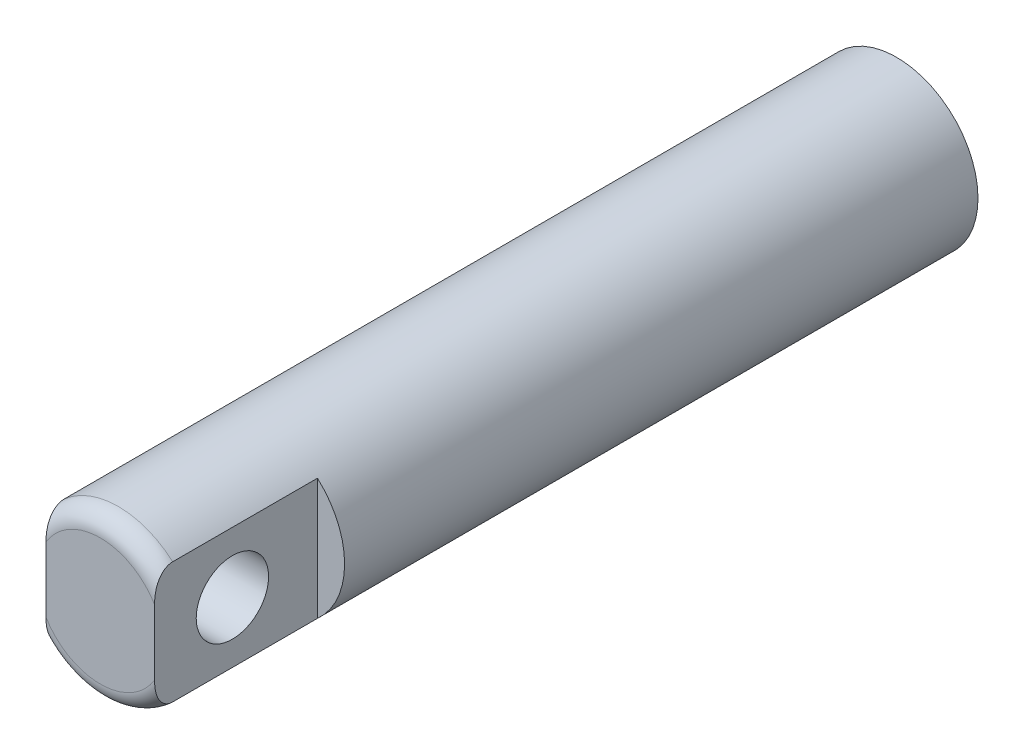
ISO-10303-21;
HEADER;
FILE_DESCRIPTION(('STEP AP214'),'2;1');
FILE_NAME('part.step','',(''),(''),'','','');
FILE_SCHEMA(('AUTOMOTIVE_DESIGN { 1 0 10303 214 1 1 1 1 }'));
ENDSEC;
DATA;
#1=APPLICATION_CONTEXT('core data for automotive mechanical design processes');
#2=APPLICATION_PROTOCOL_DEFINITION('international standard','automotive_design',2000,#1);
#3=PRODUCT_CONTEXT('',#1,'mechanical');
#4=PRODUCT('Part','Part','',(#3));
#5=PRODUCT_RELATED_PRODUCT_CATEGORY('part','',(#4));
#6=PRODUCT_DEFINITION_FORMATION('','',#4);
#7=PRODUCT_DEFINITION_CONTEXT('part definition',#1,'design');
#8=PRODUCT_DEFINITION('design','',#6,#7);
#9=PRODUCT_DEFINITION_SHAPE('','',#8);
#10=(LENGTH_UNIT() NAMED_UNIT(*) SI_UNIT(.MILLI.,.METRE.));
#11=(NAMED_UNIT(*) PLANE_ANGLE_UNIT() SI_UNIT($,.RADIAN.));
#12=(NAMED_UNIT(*) SI_UNIT($,.STERADIAN.) SOLID_ANGLE_UNIT());
#13=UNCERTAINTY_MEASURE_WITH_UNIT(LENGTH_MEASURE(1.E-05),#10,'distance_accuracy_value','');
#14=(GEOMETRIC_REPRESENTATION_CONTEXT(3) GLOBAL_UNCERTAINTY_ASSIGNED_CONTEXT((#13)) GLOBAL_UNIT_ASSIGNED_CONTEXT((#10,
#11,#12)) REPRESENTATION_CONTEXT('',''));
#15=CARTESIAN_POINT('',(0.,0.,0.));
#16=DIRECTION('',(0.,0.,1.));
#17=DIRECTION('',(1.,0.,0.));
#18=AXIS2_PLACEMENT_3D('',#15,#16,#17);
#19=CARTESIAN_POINT('',(0.,0.,35.));
#20=DIRECTION('',(0.,0.,1.));
#21=DIRECTION('',(1.,0.,0.));
#22=AXIS2_PLACEMENT_3D('',#19,#20,#21);
#23=PLANE('',#22);
#24=CARTESIAN_POINT('',(0.,0.,35.));
#25=DIRECTION('',(0.,0.,1.));
#26=DIRECTION('',(1.,0.,0.));
#27=AXIS2_PLACEMENT_3D('',#24,#25,#26);
#28=CIRCLE('',#27,4.5);
#29=CARTESIAN_POINT('',(-3.,3.35410196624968,35.));
#30=VERTEX_POINT('',#29);
#31=CARTESIAN_POINT('',(-3.,-3.35410196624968,35.));
#32=VERTEX_POINT('',#31);
#33=EDGE_CURVE('E96',#30,#32,#28,.T.);
#34=ORIENTED_EDGE('',*,*,#33,.T.);
#35=DIRECTION('',(0.,1.,0.));
#36=VECTOR('',#35,1.);
#37=CARTESIAN_POINT('',(-3.,0.,35.));
#38=LINE('',#37,#36);
#39=EDGE_CURVE('E102',#32,#30,#38,.T.);
#40=ORIENTED_EDGE('',*,*,#39,.T.);
#41=EDGE_LOOP('',(#34,#40));
#42=FACE_BOUND('',#41,.T.);
#43=ADVANCED_FACE('F35',(#42),#23,.T.);
#44=CARTESIAN_POINT('',(0.,0.,35.));
#45=DIRECTION('',(0.,0.,-1.));
#46=DIRECTION('',(-1.,0.,0.));
#47=AXIS2_PLACEMENT_3D('',#44,#45,#46);
#48=CYLINDRICAL_SURFACE('',#47,4.5);
#49=DIRECTION('',(0.,0.,-1.));
#50=VECTOR('',#49,1.);
#51=CARTESIAN_POINT('',(3.,-3.35410196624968,44.));
#52=LINE('',#51,#50);
#53=CARTESIAN_POINT('',(3.,-3.35410196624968,43.));
#54=VERTEX_POINT('',#53);
#55=CARTESIAN_POINT('',(3.,-3.35410196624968,35.));
#56=VERTEX_POINT('',#55);
#57=EDGE_CURVE('E99',#54,#56,#52,.T.);
#58=ORIENTED_EDGE('',*,*,#57,.F.);
#59=CARTESIAN_POINT('',(0.,0.,43.));
#60=DIRECTION('',(0.,0.,1.));
#61=DIRECTION('',(1.,0.,0.));
#62=AXIS2_PLACEMENT_3D('',#59,#60,#61);
#63=CIRCLE('',#62,4.5);
#64=CARTESIAN_POINT('',(-3.,-3.35410196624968,43.));
#65=VERTEX_POINT('',#64);
#66=EDGE_CURVE('E56',#54,#65,#63,.F.);
#67=ORIENTED_EDGE('',*,*,#66,.T.);
#68=DIRECTION('',(0.,0.,-1.));
#69=VECTOR('',#68,1.);
#70=CARTESIAN_POINT('',(-3.,-3.35410196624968,44.));
#71=LINE('',#70,#69);
#72=EDGE_CURVE('E91',#65,#32,#71,.T.);
#73=ORIENTED_EDGE('',*,*,#72,.T.);
#74=ORIENTED_EDGE('',*,*,#33,.F.);
#75=DIRECTION('',(0.,0.,-1.));
#76=VECTOR('',#75,1.);
#77=CARTESIAN_POINT('',(-3.,3.35410196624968,44.));
#78=LINE('',#77,#76);
#79=CARTESIAN_POINT('',(-3.,3.35410196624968,43.));
#80=VERTEX_POINT('',#79);
#81=EDGE_CURVE('E98',#80,#30,#78,.T.);
#82=ORIENTED_EDGE('',*,*,#81,.F.);
#83=CARTESIAN_POINT('',(0.,0.,43.));
#84=DIRECTION('',(0.,0.,1.));
#85=DIRECTION('',(1.,0.,0.));
#86=AXIS2_PLACEMENT_3D('',#83,#84,#85);
#87=CIRCLE('',#86,4.5);
#88=CARTESIAN_POINT('',(3.,3.35410196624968,43.));
#89=VERTEX_POINT('',#88);
#90=EDGE_CURVE('E159',#80,#89,#87,.F.);
#91=ORIENTED_EDGE('',*,*,#90,.T.);
#92=DIRECTION('',(0.,0.,-1.));
#93=VECTOR('',#92,1.);
#94=CARTESIAN_POINT('',(3.,3.35410196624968,44.));
#95=LINE('',#94,#93);
#96=CARTESIAN_POINT('',(3.,3.35410196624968,35.));
#97=VERTEX_POINT('',#96);
#98=EDGE_CURVE('E171',#89,#97,#95,.T.);
#99=ORIENTED_EDGE('',*,*,#98,.T.);
#100=EDGE_CURVE('E109',#56,#97,#28,.T.);
#101=ORIENTED_EDGE('',*,*,#100,.F.);
#102=EDGE_LOOP('',(#58,#67,#73,#74,#82,#91,#99,#101));
#103=FACE_BOUND('',#102,.T.);
#104=CARTESIAN_POINT('',(0.,0.,0.));
#105=DIRECTION('',(0.,0.,1.));
#106=DIRECTION('',(1.,0.,0.));
#107=AXIS2_PLACEMENT_3D('',#104,#105,#106);
#108=CIRCLE('',#107,4.5);
#109=CARTESIAN_POINT('',(4.5,0.,0.));
#110=VERTEX_POINT('',#109);
#111=EDGE_CURVE('E115',#110,#110,#108,.T.);
#112=ORIENTED_EDGE('',*,*,#111,.T.);
#113=EDGE_LOOP('',(#112));
#114=FACE_BOUND('',#113,.T.);
#115=ADVANCED_FACE('F93',(#103,#114),#48,.T.);
#116=DIRECTION('',(0.,1.,0.));
#117=VECTOR('',#116,1.);
#118=CARTESIAN_POINT('',(3.,0.,35.));
#119=LINE('',#118,#117);
#120=EDGE_CURVE('E105',#56,#97,#119,.T.);
#121=ORIENTED_EDGE('',*,*,#120,.F.);
#122=ORIENTED_EDGE('',*,*,#100,.T.);
#123=EDGE_LOOP('',(#121,#122));
#124=FACE_BOUND('',#123,.T.);
#125=ADVANCED_FACE('F151',(#124),#23,.T.);
#126=CARTESIAN_POINT('',(0.,0.,0.));
#127=DIRECTION('',(0.,0.,1.));
#128=DIRECTION('',(1.,0.,0.));
#129=AXIS2_PLACEMENT_3D('',#126,#127,#128);
#130=PLANE('',#129);
#131=ORIENTED_EDGE('',*,*,#111,.F.);
#132=EDGE_LOOP('',(#131));
#133=FACE_BOUND('',#132,.T.);
#134=ADVANCED_FACE('F149',(#133),#130,.F.);
#135=CARTESIAN_POINT('',(-3.,0.,44.));
#136=DIRECTION('',(-1.,0.,0.));
#137=DIRECTION('',(0.,0.,1.));
#138=AXIS2_PLACEMENT_3D('',#135,#136,#137);
#139=PLANE('',#138);
#140=CARTESIAN_POINT('',(-3.,0.,39.7));
#141=DIRECTION('',(-1.,0.,0.));
#142=DIRECTION('',(0.,0.,1.));
#143=AXIS2_PLACEMENT_3D('',#140,#141,#142);
#144=CIRCLE('',#143,2.);
#145=CARTESIAN_POINT('',(-3.,0.,41.7));
#146=VERTEX_POINT('',#145);
#147=EDGE_CURVE('E121',#146,#146,#144,.T.);
#148=ORIENTED_EDGE('',*,*,#147,.F.);
#149=EDGE_LOOP('',(#148));
#150=FACE_BOUND('',#149,.T.);
#151=ORIENTED_EDGE('',*,*,#72,.F.);
#152=CARTESIAN_POINT('',(-3.,-3.35410196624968,43.));
#153=CARTESIAN_POINT('',(-3.,-3.35410454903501,43.0227438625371));
#154=CARTESIAN_POINT('',(-3.,-3.35306009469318,43.0454749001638));
#155=CARTESIAN_POINT('',(-3.,-3.34891222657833,43.0907369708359));
#156=CARTESIAN_POINT('',(-3.,-3.34580985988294,43.1132680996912));
#157=CARTESIAN_POINT('',(-3.,-3.33352701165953,43.1800084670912));
#158=CARTESIAN_POINT('',(-3.,-3.32136959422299,43.2237015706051));
#159=CARTESIAN_POINT('',(-3.,-3.28985961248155,43.3082718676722));
#160=CARTESIAN_POINT('',(-3.,-3.27051886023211,43.3491535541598));
#161=CARTESIAN_POINT('',(-3.,-3.22563998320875,43.4274112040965));
#162=CARTESIAN_POINT('',(-3.,-3.20009153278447,43.4647811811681));
#163=CARTESIAN_POINT('',(-3.,-3.13519094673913,43.5464202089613));
#164=CARTESIAN_POINT('',(-3.,-3.09401470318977,43.5892380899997));
#165=CARTESIAN_POINT('',(-3.,-3.00528363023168,43.6675578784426));
#166=CARTESIAN_POINT('',(-3.,-2.95772326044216,43.7030533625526));
#167=CARTESIAN_POINT('',(-3.,-2.83879019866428,43.7794086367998));
#168=CARTESIAN_POINT('',(-3.,-2.76533540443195,43.8170109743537));
#169=CARTESIAN_POINT('',(-3.,-2.61322737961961,43.880326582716));
#170=CARTESIAN_POINT('',(-3.,-2.53454852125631,43.9059753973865));
#171=CARTESIAN_POINT('',(-3.,-2.34752333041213,43.9540625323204));
#172=CARTESIAN_POINT('',(-3.,-2.23815778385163,43.9724682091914));
#173=CARTESIAN_POINT('',(-3.,-2.07412278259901,43.9896598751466));
#174=CARTESIAN_POINT('',(-3.,-2.01986832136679,43.9936624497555));
#175=CARTESIAN_POINT('',(-3.,-1.91133646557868,43.9988264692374));
#176=CARTESIAN_POINT('',(-3.,-1.85705936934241,43.9999939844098));
#177=CARTESIAN_POINT('',(-3.,-1.80277563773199,44.));
#178=B_SPLINE_CURVE_WITH_KNOTS('',3,(#152,#153,#154,#155,#156,#157,#158,#159,#160,#161,#162,
#163,#164,#165,#166,#167,#168,#169,#170,#171,#172,#173,#174,#175,#176,#177),.UNSPECIFIED.,.F.,
.F.,(4,2,2,2,2,2,2,2,2,2,2,2,4),(0.,0.0681829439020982,0.136331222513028,0.271631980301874,
0.406711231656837,0.542016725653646,0.71925550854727,0.896649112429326,1.14283280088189,
1.39032903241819,1.72168681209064,1.88484827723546,2.04766007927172),.UNSPECIFIED.);
#179=CARTESIAN_POINT('',(-3.,-1.80277563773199,44.));
#180=VERTEX_POINT('',#179);
#181=EDGE_CURVE('E11',#65,#180,#178,.T.);
#182=ORIENTED_EDGE('',*,*,#181,.T.);
#183=DIRECTION('',(0.,1.,0.));
#184=VECTOR('',#183,1.);
#185=CARTESIAN_POINT('',(-3.,0.,44.));
#186=LINE('',#185,#184);
#187=CARTESIAN_POINT('',(-3.,1.80277563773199,44.));
#188=VERTEX_POINT('',#187);
#189=EDGE_CURVE('E175',#180,#188,#186,.T.);
#190=ORIENTED_EDGE('',*,*,#189,.T.);
#191=CARTESIAN_POINT('',(-3.,1.80277563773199,44.));
#192=CARTESIAN_POINT('',(-3.,1.86473915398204,43.999992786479));
#193=CARTESIAN_POINT('',(-3.,1.92675064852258,43.998470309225));
#194=CARTESIAN_POINT('',(-3.,2.05078914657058,43.9916379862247));
#195=CARTESIAN_POINT('',(-3.,2.11281534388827,43.9863140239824));
#196=CARTESIAN_POINT('',(-3.,2.23730506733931,43.9709914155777));
#197=CARTESIAN_POINT('',(-3.,2.29976017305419,43.9609206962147));
#198=CARTESIAN_POINT('',(-3.,2.42344502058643,43.9352569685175));
#199=CARTESIAN_POINT('',(-3.,2.48467656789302,43.9196728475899));
#200=CARTESIAN_POINT('',(-3.,2.61234803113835,43.879881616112));
#201=CARTESIAN_POINT('',(-3.,2.67854464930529,43.8548711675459));
#202=CARTESIAN_POINT('',(-3.,2.80653228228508,43.7957666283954));
#203=CARTESIAN_POINT('',(-3.,2.86834066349,43.7617112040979));
#204=CARTESIAN_POINT('',(-3.,2.97499791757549,43.6904697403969));
#205=CARTESIAN_POINT('',(-3.,3.02091493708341,43.6548963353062));
#206=CARTESIAN_POINT('',(-3.,3.10641620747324,43.5767219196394));
#207=CARTESIAN_POINT('',(-3.,3.14600368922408,43.5341245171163));
#208=CARTESIAN_POINT('',(-3.,3.20989194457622,43.4510406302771));
#209=CARTESIAN_POINT('',(-3.,3.23566809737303,43.4116915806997));
#210=CARTESIAN_POINT('',(-3.,3.28033489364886,43.3292989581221));
#211=CARTESIAN_POINT('',(-3.,3.29923796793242,43.286262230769));
#212=CARTESIAN_POINT('',(-3.,3.32720196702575,43.2030734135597));
#213=CARTESIAN_POINT('',(-3.,3.33720012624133,43.1632367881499));
#214=CARTESIAN_POINT('',(-3.,3.350694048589,43.0822883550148));
#215=CARTESIAN_POINT('',(-3.,3.35415849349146,43.0411713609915));
#216=CARTESIAN_POINT('',(-3.,3.35410196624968,43.));
#217=B_SPLINE_CURVE_WITH_KNOTS('',3,(#191,#192,#193,#194,#195,#196,#197,#198,#199,#200,#201,
#202,#203,#204,#205,#206,#207,#208,#209,#210,#211,#212,#213,#214,#215,#216),.UNSPECIFIED.,.F.,
.F.,(4,2,2,2,2,2,2,2,2,2,2,2,4),(0.,0.185944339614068,0.372582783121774,0.562151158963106,
0.751415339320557,0.963120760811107,1.17393533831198,1.34755258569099,1.52108092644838,
1.66162972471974,1.80192304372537,1.92461580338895,2.04789518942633),.UNSPECIFIED.);
#218=EDGE_CURVE('E49',#188,#80,#217,.T.);
#219=ORIENTED_EDGE('',*,*,#218,.T.);
#220=ORIENTED_EDGE('',*,*,#81,.T.);
#221=ORIENTED_EDGE('',*,*,#39,.F.);
#222=EDGE_LOOP('',(#151,#182,#190,#219,#220,#221));
#223=FACE_BOUND('',#222,.T.);
#224=ADVANCED_FACE('F103',(#150,#223),#139,.T.);
#225=CARTESIAN_POINT('',(3.,0.,44.));
#226=DIRECTION('',(-1.,0.,0.));
#227=DIRECTION('',(0.,0.,1.));
#228=AXIS2_PLACEMENT_3D('',#225,#226,#227);
#229=PLANE('',#228);
#230=CARTESIAN_POINT('',(3.,0.,39.7));
#231=DIRECTION('',(-1.,0.,0.));
#232=DIRECTION('',(0.,0.,1.));
#233=AXIS2_PLACEMENT_3D('',#230,#231,#232);
#234=CIRCLE('',#233,2.);
#235=CARTESIAN_POINT('',(3.,0.,41.7));
#236=VERTEX_POINT('',#235);
#237=EDGE_CURVE('E106',#236,#236,#234,.T.);
#238=ORIENTED_EDGE('',*,*,#237,.T.);
#239=EDGE_LOOP('',(#238));
#240=FACE_BOUND('',#239,.T.);
#241=DIRECTION('',(0.,1.,0.));
#242=VECTOR('',#241,1.);
#243=CARTESIAN_POINT('',(3.,0.,44.));
#244=LINE('',#243,#242);
#245=CARTESIAN_POINT('',(3.,-1.80277563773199,44.));
#246=VERTEX_POINT('',#245);
#247=CARTESIAN_POINT('',(3.,1.80277563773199,44.));
#248=VERTEX_POINT('',#247);
#249=EDGE_CURVE('E167',#246,#248,#244,.T.);
#250=ORIENTED_EDGE('',*,*,#249,.F.);
#251=CARTESIAN_POINT('',(3.,-1.80277563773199,44.));
#252=CARTESIAN_POINT('',(3.,-1.86473915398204,43.999992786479));
#253=CARTESIAN_POINT('',(3.,-1.92675064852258,43.998470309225));
#254=CARTESIAN_POINT('',(3.,-2.05078914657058,43.9916379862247));
#255=CARTESIAN_POINT('',(3.,-2.11281534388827,43.9863140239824));
#256=CARTESIAN_POINT('',(3.,-2.23730506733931,43.9709914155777));
#257=CARTESIAN_POINT('',(3.,-2.29976017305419,43.9609206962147));
#258=CARTESIAN_POINT('',(3.,-2.42344502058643,43.9352569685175));
#259=CARTESIAN_POINT('',(3.,-2.48467656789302,43.9196728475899));
#260=CARTESIAN_POINT('',(3.,-2.61234803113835,43.879881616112));
#261=CARTESIAN_POINT('',(3.,-2.67854464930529,43.8548711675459));
#262=CARTESIAN_POINT('',(3.,-2.80653228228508,43.7957666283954));
#263=CARTESIAN_POINT('',(3.,-2.86834066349,43.7617112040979));
#264=CARTESIAN_POINT('',(3.,-2.97499791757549,43.6904697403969));
#265=CARTESIAN_POINT('',(3.,-3.02091493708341,43.6548963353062));
#266=CARTESIAN_POINT('',(3.,-3.10641620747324,43.5767219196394));
#267=CARTESIAN_POINT('',(3.,-3.14600368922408,43.5341245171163));
#268=CARTESIAN_POINT('',(3.,-3.20989194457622,43.4510406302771));
#269=CARTESIAN_POINT('',(3.,-3.23566809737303,43.4116915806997));
#270=CARTESIAN_POINT('',(3.,-3.28033489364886,43.3292989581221));
#271=CARTESIAN_POINT('',(3.,-3.29923796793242,43.286262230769));
#272=CARTESIAN_POINT('',(3.,-3.32720196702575,43.2030734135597));
#273=CARTESIAN_POINT('',(3.,-3.33720012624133,43.1632367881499));
#274=CARTESIAN_POINT('',(3.,-3.350694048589,43.0822883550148));
#275=CARTESIAN_POINT('',(3.,-3.35415849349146,43.0411713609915));
#276=CARTESIAN_POINT('',(3.,-3.35410196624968,43.));
#277=B_SPLINE_CURVE_WITH_KNOTS('',3,(#251,#252,#253,#254,#255,#256,#257,#258,#259,#260,#261,
#262,#263,#264,#265,#266,#267,#268,#269,#270,#271,#272,#273,#274,#275,#276),.UNSPECIFIED.,.F.,
.F.,(4,2,2,2,2,2,2,2,2,2,2,2,4),(0.,0.185944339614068,0.372582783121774,0.562151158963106,
0.751415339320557,0.963120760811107,1.17393533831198,1.34755258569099,1.52108092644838,
1.66162972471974,1.80192304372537,1.92461580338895,2.04789518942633),.UNSPECIFIED.);
#278=EDGE_CURVE('E132',#246,#54,#277,.T.);
#279=ORIENTED_EDGE('',*,*,#278,.T.);
#280=ORIENTED_EDGE('',*,*,#57,.T.);
#281=ORIENTED_EDGE('',*,*,#120,.T.);
#282=ORIENTED_EDGE('',*,*,#98,.F.);
#283=CARTESIAN_POINT('',(3.,3.35410196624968,43.));
#284=CARTESIAN_POINT('',(3.,3.35410454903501,43.0227438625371));
#285=CARTESIAN_POINT('',(3.,3.35306009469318,43.0454749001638));
#286=CARTESIAN_POINT('',(3.,3.34891222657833,43.0907369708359));
#287=CARTESIAN_POINT('',(3.,3.34580985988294,43.1132680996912));
#288=CARTESIAN_POINT('',(3.,3.33352701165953,43.1800084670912));
#289=CARTESIAN_POINT('',(3.,3.32136959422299,43.2237015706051));
#290=CARTESIAN_POINT('',(3.,3.28985961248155,43.3082718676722));
#291=CARTESIAN_POINT('',(3.,3.27051886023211,43.3491535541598));
#292=CARTESIAN_POINT('',(3.,3.22563998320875,43.4274112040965));
#293=CARTESIAN_POINT('',(3.,3.20009153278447,43.4647811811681));
#294=CARTESIAN_POINT('',(3.,3.13519094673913,43.5464202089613));
#295=CARTESIAN_POINT('',(3.,3.09401470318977,43.5892380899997));
#296=CARTESIAN_POINT('',(3.,3.00528363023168,43.6675578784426));
#297=CARTESIAN_POINT('',(3.,2.95772326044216,43.7030533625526));
#298=CARTESIAN_POINT('',(3.,2.83879019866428,43.7794086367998));
#299=CARTESIAN_POINT('',(3.,2.76533540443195,43.8170109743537));
#300=CARTESIAN_POINT('',(3.,2.61322737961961,43.880326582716));
#301=CARTESIAN_POINT('',(3.,2.53454852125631,43.9059753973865));
#302=CARTESIAN_POINT('',(3.,2.34752333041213,43.9540625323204));
#303=CARTESIAN_POINT('',(3.,2.23815778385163,43.9724682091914));
#304=CARTESIAN_POINT('',(3.,2.07412278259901,43.9896598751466));
#305=CARTESIAN_POINT('',(3.,2.01986832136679,43.9936624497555));
#306=CARTESIAN_POINT('',(3.,1.91133646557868,43.9988264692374));
#307=CARTESIAN_POINT('',(3.,1.85705936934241,43.9999939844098));
#308=CARTESIAN_POINT('',(3.,1.80277563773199,44.));
#309=B_SPLINE_CURVE_WITH_KNOTS('',3,(#283,#284,#285,#286,#287,#288,#289,#290,#291,#292,#293,
#294,#295,#296,#297,#298,#299,#300,#301,#302,#303,#304,#305,#306,#307,#308),.UNSPECIFIED.,.F.,
.F.,(4,2,2,2,2,2,2,2,2,2,2,2,4),(0.,0.0681829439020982,0.136331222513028,0.271631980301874,
0.406711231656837,0.542016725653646,0.71925550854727,0.896649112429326,1.14283280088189,
1.39032903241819,1.72168681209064,1.88484827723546,2.04766007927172),.UNSPECIFIED.);
#310=EDGE_CURVE('E125',#89,#248,#309,.T.);
#311=ORIENTED_EDGE('',*,*,#310,.T.);
#312=EDGE_LOOP('',(#250,#279,#280,#281,#282,#311));
#313=FACE_BOUND('',#312,.T.);
#314=ADVANCED_FACE('F138',(#240,#313),#229,.F.);
#315=CARTESIAN_POINT('',(0.,0.,44.));
#316=DIRECTION('',(0.,0.,1.));
#317=DIRECTION('',(1.,0.,0.));
#318=AXIS2_PLACEMENT_3D('',#315,#316,#317);
#319=PLANE('',#318);
#320=ORIENTED_EDGE('',*,*,#189,.F.);
#321=CARTESIAN_POINT('',(0.,0.,44.));
#322=DIRECTION('',(0.,0.,1.));
#323=DIRECTION('',(1.,0.,0.));
#324=AXIS2_PLACEMENT_3D('',#321,#322,#323);
#325=CIRCLE('',#324,3.5);
#326=EDGE_CURVE('E112',#180,#246,#325,.T.);
#327=ORIENTED_EDGE('',*,*,#326,.T.);
#328=ORIENTED_EDGE('',*,*,#249,.T.);
#329=CARTESIAN_POINT('',(0.,0.,44.));
#330=DIRECTION('',(0.,0.,1.));
#331=DIRECTION('',(1.,0.,0.));
#332=AXIS2_PLACEMENT_3D('',#329,#330,#331);
#333=CIRCLE('',#332,3.5);
#334=EDGE_CURVE('E108',#248,#188,#333,.T.);
#335=ORIENTED_EDGE('',*,*,#334,.T.);
#336=EDGE_LOOP('',(#320,#327,#328,#335));
#337=FACE_BOUND('',#336,.T.);
#338=ADVANCED_FACE('F142',(#337),#319,.T.);
#339=CARTESIAN_POINT('',(4.5,0.,39.7));
#340=DIRECTION('',(-1.,0.,0.));
#341=DIRECTION('',(0.,0.,1.));
#342=AXIS2_PLACEMENT_3D('',#339,#340,#341);
#343=CYLINDRICAL_SURFACE('',#342,2.);
#344=ORIENTED_EDGE('',*,*,#147,.T.);
#345=EDGE_LOOP('',(#344));
#346=FACE_BOUND('',#345,.T.);
#347=ORIENTED_EDGE('',*,*,#237,.F.);
#348=EDGE_LOOP('',(#347));
#349=FACE_BOUND('',#348,.T.);
#350=ADVANCED_FACE('F208',(#346,#349),#343,.F.);
#351=CARTESIAN_POINT('',(0.,0.,43.));
#352=DIRECTION('',(0.,0.,1.));
#353=DIRECTION('',(1.,0.,0.));
#354=AXIS2_PLACEMENT_3D('',#351,#352,#353);
#355=TOROIDAL_SURFACE('',#354,3.5,1.);
#356=ORIENTED_EDGE('',*,*,#181,.F.);
#357=ORIENTED_EDGE('',*,*,#66,.F.);
#358=ORIENTED_EDGE('',*,*,#278,.F.);
#359=ORIENTED_EDGE('',*,*,#326,.F.);
#360=EDGE_LOOP('',(#356,#357,#358,#359));
#361=FACE_BOUND('',#360,.T.);
#362=ADVANCED_FACE('F173',(#361),#355,.T.);
#363=CARTESIAN_POINT('',(0.,0.,43.));
#364=DIRECTION('',(0.,0.,1.));
#365=DIRECTION('',(1.,0.,0.));
#366=AXIS2_PLACEMENT_3D('',#363,#364,#365);
#367=TOROIDAL_SURFACE('',#366,3.5,1.);
#368=ORIENTED_EDGE('',*,*,#310,.F.);
#369=ORIENTED_EDGE('',*,*,#90,.F.);
#370=ORIENTED_EDGE('',*,*,#218,.F.);
#371=ORIENTED_EDGE('',*,*,#334,.F.);
#372=EDGE_LOOP('',(#368,#369,#370,#371));
#373=FACE_BOUND('',#372,.T.);
#374=ADVANCED_FACE('F37',(#373),#367,.T.);
#375=CLOSED_SHELL('',(#43,#115,#125,#134,#224,#314,#338,#350,#362,#374));
#376=MANIFOLD_SOLID_BREP('B2',#375);
#377=ADVANCED_BREP_SHAPE_REPRESENTATION('',(#18,#376),#14);
#378=SHAPE_DEFINITION_REPRESENTATION(#9,#377);
ENDSEC;
END-ISO-10303-21;
